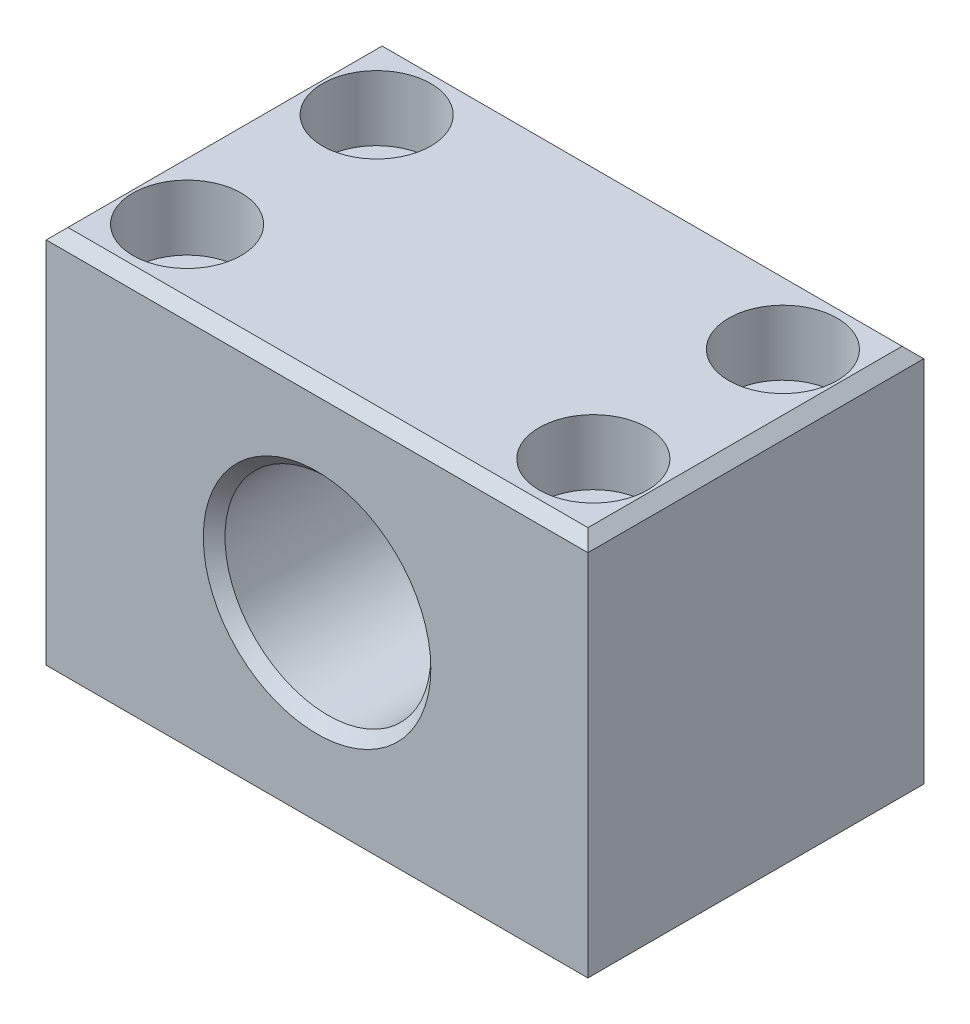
ISO-10303-21;
HEADER;
FILE_DESCRIPTION(('STEP AP214'),'2;1');
FILE_NAME('part.step','',(''),(''),'','','');
FILE_SCHEMA(('AUTOMOTIVE_DESIGN { 1 0 10303 214 1 1 1 1 }'));
ENDSEC;
DATA;
#1=APPLICATION_CONTEXT('core data for automotive mechanical design processes');
#2=APPLICATION_PROTOCOL_DEFINITION('international standard','automotive_design',2000,#1);
#3=PRODUCT_CONTEXT('',#1,'mechanical');
#4=PRODUCT('Part','Part','',(#3));
#5=PRODUCT_RELATED_PRODUCT_CATEGORY('part','',(#4));
#6=PRODUCT_DEFINITION_FORMATION('','',#4);
#7=PRODUCT_DEFINITION_CONTEXT('part definition',#1,'design');
#8=PRODUCT_DEFINITION('design','',#6,#7);
#9=PRODUCT_DEFINITION_SHAPE('','',#8);
#10=(LENGTH_UNIT() NAMED_UNIT(*) SI_UNIT(.MILLI.,.METRE.));
#11=(NAMED_UNIT(*) PLANE_ANGLE_UNIT() SI_UNIT($,.RADIAN.));
#12=(NAMED_UNIT(*) SI_UNIT($,.STERADIAN.) SOLID_ANGLE_UNIT());
#13=UNCERTAINTY_MEASURE_WITH_UNIT(LENGTH_MEASURE(1.E-05),#10,'distance_accuracy_value','');
#14=(GEOMETRIC_REPRESENTATION_CONTEXT(3) GLOBAL_UNCERTAINTY_ASSIGNED_CONTEXT((#13)) GLOBAL_UNIT_ASSIGNED_CONTEXT((#10,
#11,#12)) REPRESENTATION_CONTEXT('',''));
#15=CARTESIAN_POINT('',(0.,0.,0.));
#16=DIRECTION('',(0.,0.,1.));
#17=DIRECTION('',(1.,0.,0.));
#18=AXIS2_PLACEMENT_3D('',#15,#16,#17);
#19=CARTESIAN_POINT('',(-50.,35.,31.));
#20=DIRECTION('',(1.,0.,0.));
#21=DIRECTION('',(0.,1.,0.));
#22=AXIS2_PLACEMENT_3D('',#19,#20,#21);
#23=PLANE('',#22);
#24=DIRECTION('',(0.,-1.,0.));
#25=VECTOR('',#24,1.);
#26=CARTESIAN_POINT('',(-50.,35.,31.));
#27=LINE('',#26,#25);
#28=CARTESIAN_POINT('',(-50.,33.,31.));
#29=VERTEX_POINT('',#28);
#30=CARTESIAN_POINT('',(-50.,-35.,31.));
#31=VERTEX_POINT('',#30);
#32=EDGE_CURVE('E88',#29,#31,#27,.T.);
#33=ORIENTED_EDGE('',*,*,#32,.F.);
#34=DIRECTION('',(0.,0.,-1.));
#35=VECTOR('',#34,1.);
#36=CARTESIAN_POINT('',(-50.,33.,31.));
#37=LINE('',#36,#35);
#38=CARTESIAN_POINT('',(-50.,33.,-31.));
#39=VERTEX_POINT('',#38);
#40=EDGE_CURVE('E52',#29,#39,#37,.T.);
#41=ORIENTED_EDGE('',*,*,#40,.T.);
#42=DIRECTION('',(0.,-1.,0.));
#43=VECTOR('',#42,1.);
#44=CARTESIAN_POINT('',(-50.,35.,-31.));
#45=LINE('',#44,#43);
#46=CARTESIAN_POINT('',(-50.,-35.,-31.));
#47=VERTEX_POINT('',#46);
#48=EDGE_CURVE('E105',#39,#47,#45,.T.);
#49=ORIENTED_EDGE('',*,*,#48,.T.);
#50=DIRECTION('',(0.,0.,-1.));
#51=VECTOR('',#50,1.);
#52=CARTESIAN_POINT('',(-50.,-35.,31.));
#53=LINE('',#52,#51);
#54=EDGE_CURVE('E99',#31,#47,#53,.T.);
#55=ORIENTED_EDGE('',*,*,#54,.F.);
#56=EDGE_LOOP('',(#33,#41,#49,#55));
#57=FACE_BOUND('',#56,.T.);
#58=ADVANCED_FACE('F35',(#57),#23,.F.);
#59=CARTESIAN_POINT('',(-50.,-35.,31.));
#60=DIRECTION('',(0.,1.,0.));
#61=DIRECTION('',(0.,0.,1.));
#62=AXIS2_PLACEMENT_3D('',#59,#60,#61);
#63=PLANE('',#62);
#64=CARTESIAN_POINT('',(37.5,-35.,17.5));
#65=DIRECTION('',(0.,1.,0.));
#66=DIRECTION('',(0.,0.,1.));
#67=AXIS2_PLACEMENT_3D('',#64,#65,#66);
#68=CIRCLE('',#67,6.09999999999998);
#69=CARTESIAN_POINT('',(37.5,-35.,23.6));
#70=VERTEX_POINT('',#69);
#71=EDGE_CURVE('E419',#70,#70,#68,.T.);
#72=ORIENTED_EDGE('',*,*,#71,.T.);
#73=EDGE_LOOP('',(#72));
#74=FACE_BOUND('',#73,.T.);
#75=CARTESIAN_POINT('',(37.5,-35.,-17.5));
#76=DIRECTION('',(0.,1.,0.));
#77=DIRECTION('',(0.,0.,1.));
#78=AXIS2_PLACEMENT_3D('',#75,#76,#77);
#79=CIRCLE('',#78,6.09999999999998);
#80=CARTESIAN_POINT('',(37.5,-35.,-11.4));
#81=VERTEX_POINT('',#80);
#82=EDGE_CURVE('E431',#81,#81,#79,.T.);
#83=ORIENTED_EDGE('',*,*,#82,.T.);
#84=EDGE_LOOP('',(#83));
#85=FACE_BOUND('',#84,.T.);
#86=CARTESIAN_POINT('',(-37.5,-35.,17.5));
#87=DIRECTION('',(0.,1.,0.));
#88=DIRECTION('',(0.,0.,1.));
#89=AXIS2_PLACEMENT_3D('',#86,#87,#88);
#90=CIRCLE('',#89,6.09999999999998);
#91=CARTESIAN_POINT('',(-37.5,-35.,23.6));
#92=VERTEX_POINT('',#91);
#93=EDGE_CURVE('E443',#92,#92,#90,.T.);
#94=ORIENTED_EDGE('',*,*,#93,.T.);
#95=EDGE_LOOP('',(#94));
#96=FACE_BOUND('',#95,.T.);
#97=CARTESIAN_POINT('',(-37.5,-35.,-17.5));
#98=DIRECTION('',(0.,1.,0.));
#99=DIRECTION('',(0.,0.,1.));
#100=AXIS2_PLACEMENT_3D('',#97,#98,#99);
#101=CIRCLE('',#100,6.09999999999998);
#102=CARTESIAN_POINT('',(-37.5,-35.,-11.4));
#103=VERTEX_POINT('',#102);
#104=EDGE_CURVE('E138',#103,#103,#101,.T.);
#105=ORIENTED_EDGE('',*,*,#104,.T.);
#106=EDGE_LOOP('',(#105));
#107=FACE_BOUND('',#106,.T.);
#108=DIRECTION('',(1.,0.,0.));
#109=VECTOR('',#108,1.);
#110=CARTESIAN_POINT('',(-50.,-35.,-31.));
#111=LINE('',#110,#109);
#112=CARTESIAN_POINT('',(50.,-35.,-31.));
#113=VERTEX_POINT('',#112);
#114=EDGE_CURVE('E149',#47,#113,#111,.T.);
#115=ORIENTED_EDGE('',*,*,#114,.T.);
#116=DIRECTION('',(0.,0.,-1.));
#117=VECTOR('',#116,1.);
#118=CARTESIAN_POINT('',(50.,-35.,31.));
#119=LINE('',#118,#117);
#120=CARTESIAN_POINT('',(50.,-35.,31.));
#121=VERTEX_POINT('',#120);
#122=EDGE_CURVE('E101',#121,#113,#119,.T.);
#123=ORIENTED_EDGE('',*,*,#122,.F.);
#124=DIRECTION('',(1.,0.,0.));
#125=VECTOR('',#124,1.);
#126=CARTESIAN_POINT('',(-50.,-35.,31.));
#127=LINE('',#126,#125);
#128=EDGE_CURVE('E91',#31,#121,#127,.T.);
#129=ORIENTED_EDGE('',*,*,#128,.F.);
#130=ORIENTED_EDGE('',*,*,#54,.T.);
#131=EDGE_LOOP('',(#115,#123,#129,#130));
#132=FACE_BOUND('',#131,.T.);
#133=ADVANCED_FACE('F98',(#74,#85,#96,#107,#132),#63,.F.);
#134=CARTESIAN_POINT('',(50.,35.,31.));
#135=DIRECTION('',(-1.,0.,0.));
#136=DIRECTION('',(0.,-1.,0.));
#137=AXIS2_PLACEMENT_3D('',#134,#135,#136);
#138=PLANE('',#137);
#139=DIRECTION('',(0.,1.,0.));
#140=VECTOR('',#139,1.);
#141=CARTESIAN_POINT('',(50.,35.,-31.));
#142=LINE('',#141,#140);
#143=CARTESIAN_POINT('',(50.,33.,-31.));
#144=VERTEX_POINT('',#143);
#145=EDGE_CURVE('E94',#113,#144,#142,.T.);
#146=ORIENTED_EDGE('',*,*,#145,.T.);
#147=DIRECTION('',(0.,0.,1.));
#148=VECTOR('',#147,1.);
#149=CARTESIAN_POINT('',(50.,33.,31.));
#150=LINE('',#149,#148);
#151=CARTESIAN_POINT('',(50.,33.,31.));
#152=VERTEX_POINT('',#151);
#153=EDGE_CURVE('E120',#144,#152,#150,.T.);
#154=ORIENTED_EDGE('',*,*,#153,.T.);
#155=DIRECTION('',(0.,1.,0.));
#156=VECTOR('',#155,1.);
#157=CARTESIAN_POINT('',(50.,35.,31.));
#158=LINE('',#157,#156);
#159=EDGE_CURVE('E103',#121,#152,#158,.T.);
#160=ORIENTED_EDGE('',*,*,#159,.F.);
#161=ORIENTED_EDGE('',*,*,#122,.T.);
#162=EDGE_LOOP('',(#146,#154,#160,#161));
#163=FACE_BOUND('',#162,.T.);
#164=ADVANCED_FACE('F157',(#163),#138,.F.);
#165=CARTESIAN_POINT('',(-50.,35.,31.));
#166=DIRECTION('',(0.,-1.,0.));
#167=DIRECTION('',(0.,0.,-1.));
#168=AXIS2_PLACEMENT_3D('',#165,#166,#167);
#169=PLANE('',#168);
#170=CARTESIAN_POINT('',(37.5,35.,17.5));
#171=DIRECTION('',(0.,1.,0.));
#172=DIRECTION('',(0.,0.,1.));
#173=AXIS2_PLACEMENT_3D('',#170,#171,#172);
#174=CIRCLE('',#173,10.);
#175=CARTESIAN_POINT('',(37.5,35.,27.5));
#176=VERTEX_POINT('',#175);
#177=EDGE_CURVE('E412',#176,#176,#174,.T.);
#178=ORIENTED_EDGE('',*,*,#177,.F.);
#179=EDGE_LOOP('',(#178));
#180=FACE_BOUND('',#179,.T.);
#181=CARTESIAN_POINT('',(37.5,35.,-17.5));
#182=DIRECTION('',(0.,1.,0.));
#183=DIRECTION('',(0.,0.,1.));
#184=AXIS2_PLACEMENT_3D('',#181,#182,#183);
#185=CIRCLE('',#184,10.);
#186=CARTESIAN_POINT('',(37.5,35.,-7.5));
#187=VERTEX_POINT('',#186);
#188=EDGE_CURVE('E422',#187,#187,#185,.T.);
#189=ORIENTED_EDGE('',*,*,#188,.F.);
#190=EDGE_LOOP('',(#189));
#191=FACE_BOUND('',#190,.T.);
#192=CARTESIAN_POINT('',(-37.5,35.,17.5));
#193=DIRECTION('',(0.,1.,0.));
#194=DIRECTION('',(0.,0.,1.));
#195=AXIS2_PLACEMENT_3D('',#192,#193,#194);
#196=CIRCLE('',#195,10.);
#197=CARTESIAN_POINT('',(-37.5,35.,27.5));
#198=VERTEX_POINT('',#197);
#199=EDGE_CURVE('E434',#198,#198,#196,.T.);
#200=ORIENTED_EDGE('',*,*,#199,.F.);
#201=EDGE_LOOP('',(#200));
#202=FACE_BOUND('',#201,.T.);
#203=CARTESIAN_POINT('',(-37.5,35.,-17.5));
#204=DIRECTION('',(0.,1.,0.));
#205=DIRECTION('',(0.,0.,1.));
#206=AXIS2_PLACEMENT_3D('',#203,#204,#205);
#207=CIRCLE('',#206,10.);
#208=CARTESIAN_POINT('',(-37.5,35.,-7.5));
#209=VERTEX_POINT('',#208);
#210=EDGE_CURVE('E446',#209,#209,#207,.T.);
#211=ORIENTED_EDGE('',*,*,#210,.F.);
#212=EDGE_LOOP('',(#211));
#213=FACE_BOUND('',#212,.T.);
#214=DIRECTION('',(1.,0.,0.));
#215=VECTOR('',#214,1.);
#216=CARTESIAN_POINT('',(50.,35.,29.));
#217=LINE('',#216,#215);
#218=CARTESIAN_POINT('',(-48.,35.,29.));
#219=VERTEX_POINT('',#218);
#220=CARTESIAN_POINT('',(48.,35.,29.));
#221=VERTEX_POINT('',#220);
#222=EDGE_CURVE('E115',#219,#221,#217,.T.);
#223=ORIENTED_EDGE('',*,*,#222,.T.);
#224=DIRECTION('',(0.,0.,-1.));
#225=VECTOR('',#224,1.);
#226=CARTESIAN_POINT('',(48.,35.,31.));
#227=LINE('',#226,#225);
#228=CARTESIAN_POINT('',(48.,35.,-29.));
#229=VERTEX_POINT('',#228);
#230=EDGE_CURVE('E117',#221,#229,#227,.T.);
#231=ORIENTED_EDGE('',*,*,#230,.T.);
#232=DIRECTION('',(-1.,0.,0.));
#233=VECTOR('',#232,1.);
#234=CARTESIAN_POINT('',(-50.,35.,-29.));
#235=LINE('',#234,#233);
#236=CARTESIAN_POINT('',(-48.,35.,-29.));
#237=VERTEX_POINT('',#236);
#238=EDGE_CURVE('E107',#229,#237,#235,.T.);
#239=ORIENTED_EDGE('',*,*,#238,.T.);
#240=DIRECTION('',(0.,0.,1.));
#241=VECTOR('',#240,1.);
#242=CARTESIAN_POINT('',(-48.,35.,31.));
#243=LINE('',#242,#241);
#244=EDGE_CURVE('E109',#237,#219,#243,.T.);
#245=ORIENTED_EDGE('',*,*,#244,.T.);
#246=EDGE_LOOP('',(#223,#231,#239,#245));
#247=FACE_BOUND('',#246,.T.);
#248=ADVANCED_FACE('F167',(#180,#191,#202,#213,#247),#169,.F.);
#249=CARTESIAN_POINT('',(0.,0.,31.));
#250=DIRECTION('',(0.,0.,1.));
#251=DIRECTION('',(1.,0.,0.));
#252=AXIS2_PLACEMENT_3D('',#249,#250,#251);
#253=PLANE('',#252);
#254=CARTESIAN_POINT('',(0.,0.,31.));
#255=DIRECTION('',(0.,0.,1.));
#256=DIRECTION('',(1.,0.,0.));
#257=AXIS2_PLACEMENT_3D('',#254,#255,#256);
#258=CIRCLE('',#257,21.);
#259=CARTESIAN_POINT('',(21.,0.,31.));
#260=VERTEX_POINT('',#259);
#261=EDGE_CURVE('E123',#260,#260,#258,.F.);
#262=ORIENTED_EDGE('',*,*,#261,.T.);
#263=EDGE_LOOP('',(#262));
#264=FACE_BOUND('',#263,.T.);
#265=ORIENTED_EDGE('',*,*,#159,.T.);
#266=DIRECTION('',(-1.,0.,0.));
#267=VECTOR('',#266,1.);
#268=CARTESIAN_POINT('',(-50.,33.,31.));
#269=LINE('',#268,#267);
#270=EDGE_CURVE('E60',#152,#29,#269,.T.);
#271=ORIENTED_EDGE('',*,*,#270,.T.);
#272=ORIENTED_EDGE('',*,*,#32,.T.);
#273=ORIENTED_EDGE('',*,*,#128,.T.);
#274=EDGE_LOOP('',(#265,#271,#272,#273));
#275=FACE_BOUND('',#274,.T.);
#276=ADVANCED_FACE('F90',(#264,#275),#253,.T.);
#277=CARTESIAN_POINT('',(0.,0.,-31.));
#278=DIRECTION('',(0.,0.,1.));
#279=DIRECTION('',(1.,0.,0.));
#280=AXIS2_PLACEMENT_3D('',#277,#278,#279);
#281=PLANE('',#280);
#282=CARTESIAN_POINT('',(0.,0.,-31.));
#283=DIRECTION('',(0.,0.,1.));
#284=DIRECTION('',(1.,0.,0.));
#285=AXIS2_PLACEMENT_3D('',#282,#283,#284);
#286=CIRCLE('',#285,21.);
#287=CARTESIAN_POINT('',(21.,0.,-31.));
#288=VERTEX_POINT('',#287);
#289=EDGE_CURVE('E128',#288,#288,#286,.T.);
#290=ORIENTED_EDGE('',*,*,#289,.T.);
#291=EDGE_LOOP('',(#290));
#292=FACE_BOUND('',#291,.T.);
#293=ORIENTED_EDGE('',*,*,#48,.F.);
#294=DIRECTION('',(1.,0.,0.));
#295=VECTOR('',#294,1.);
#296=CARTESIAN_POINT('',(0.,33.,-31.));
#297=LINE('',#296,#295);
#298=EDGE_CURVE('E131',#39,#144,#297,.T.);
#299=ORIENTED_EDGE('',*,*,#298,.T.);
#300=ORIENTED_EDGE('',*,*,#145,.F.);
#301=ORIENTED_EDGE('',*,*,#114,.F.);
#302=EDGE_LOOP('',(#293,#299,#300,#301));
#303=FACE_BOUND('',#302,.T.);
#304=ADVANCED_FACE('F204',(#292,#303),#281,.F.);
#305=CARTESIAN_POINT('',(0.,0.,-31.));
#306=DIRECTION('',(0.,0.,1.));
#307=DIRECTION('',(1.,0.,0.));
#308=AXIS2_PLACEMENT_3D('',#305,#306,#307);
#309=CYLINDRICAL_SURFACE('',#308,19.);
#310=CARTESIAN_POINT('',(0.,0.,-29.));
#311=DIRECTION('',(0.,0.,1.));
#312=DIRECTION('',(1.,0.,0.));
#313=AXIS2_PLACEMENT_3D('',#310,#311,#312);
#314=CIRCLE('',#313,19.);
#315=CARTESIAN_POINT('',(19.,0.,-29.));
#316=VERTEX_POINT('',#315);
#317=EDGE_CURVE('E11',#316,#316,#314,.F.);
#318=ORIENTED_EDGE('',*,*,#317,.T.);
#319=EDGE_LOOP('',(#318));
#320=FACE_BOUND('',#319,.T.);
#321=CARTESIAN_POINT('',(0.,0.,29.));
#322=DIRECTION('',(0.,0.,1.));
#323=DIRECTION('',(1.,0.,0.));
#324=AXIS2_PLACEMENT_3D('',#321,#322,#323);
#325=CIRCLE('',#324,19.);
#326=CARTESIAN_POINT('',(19.,0.,29.));
#327=VERTEX_POINT('',#326);
#328=EDGE_CURVE('E44',#327,#327,#325,.T.);
#329=ORIENTED_EDGE('',*,*,#328,.T.);
#330=EDGE_LOOP('',(#329));
#331=FACE_BOUND('',#330,.T.);
#332=ADVANCED_FACE('F177',(#320,#331),#309,.F.);
#333=CARTESIAN_POINT('',(-50.,33.,31.));
#334=DIRECTION('',(0.70710678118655,-0.707106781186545,0.));
#335=DIRECTION('',(0.,0.,-1.));
#336=AXIS2_PLACEMENT_3D('',#333,#334,#335);
#337=PLANE('',#336);
#338=DIRECTION('',(0.577350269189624,0.577350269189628,0.577350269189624));
#339=VECTOR('',#338,1.);
#340=CARTESIAN_POINT('',(-48.6666666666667,34.3333333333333,-29.6666666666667));
#341=LINE('',#340,#339);
#342=EDGE_CURVE('E139',#39,#237,#341,.T.);
#343=ORIENTED_EDGE('',*,*,#342,.F.);
#344=ORIENTED_EDGE('',*,*,#40,.F.);
#345=DIRECTION('',(-0.577350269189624,-0.577350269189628,0.577350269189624));
#346=VECTOR('',#345,1.);
#347=CARTESIAN_POINT('',(-50.,33.,31.));
#348=LINE('',#347,#346);
#349=EDGE_CURVE('E39',#219,#29,#348,.T.);
#350=ORIENTED_EDGE('',*,*,#349,.F.);
#351=ORIENTED_EDGE('',*,*,#244,.F.);
#352=EDGE_LOOP('',(#343,#344,#350,#351));
#353=FACE_BOUND('',#352,.T.);
#354=ADVANCED_FACE('F170',(#353),#337,.F.);
#355=CARTESIAN_POINT('',(0.,33.,31.));
#356=DIRECTION('',(0.,0.707106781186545,0.70710678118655));
#357=DIRECTION('',(1.,0.,0.));
#358=AXIS2_PLACEMENT_3D('',#355,#356,#357);
#359=PLANE('',#358);
#360=ORIENTED_EDGE('',*,*,#349,.T.);
#361=ORIENTED_EDGE('',*,*,#270,.F.);
#362=DIRECTION('',(0.577350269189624,-0.577350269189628,0.577350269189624));
#363=VECTOR('',#362,1.);
#364=CARTESIAN_POINT('',(33.3333333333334,49.6666666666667,14.3333333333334));
#365=LINE('',#364,#363);
#366=EDGE_CURVE('E137',#221,#152,#365,.T.);
#367=ORIENTED_EDGE('',*,*,#366,.F.);
#368=ORIENTED_EDGE('',*,*,#222,.F.);
#369=EDGE_LOOP('',(#360,#361,#367,#368));
#370=FACE_BOUND('',#369,.T.);
#371=ADVANCED_FACE('F168',(#370),#359,.T.);
#372=CARTESIAN_POINT('',(-50.,35.,-29.));
#373=DIRECTION('',(0.,-0.707106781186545,0.70710678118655));
#374=DIRECTION('',(-1.,0.,0.));
#375=AXIS2_PLACEMENT_3D('',#372,#373,#374);
#376=PLANE('',#375);
#377=ORIENTED_EDGE('',*,*,#342,.T.);
#378=ORIENTED_EDGE('',*,*,#238,.F.);
#379=DIRECTION('',(0.577350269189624,-0.577350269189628,-0.577350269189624));
#380=VECTOR('',#379,1.);
#381=CARTESIAN_POINT('',(15.3333333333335,67.6666666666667,3.66666666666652));
#382=LINE('',#381,#380);
#383=EDGE_CURVE('E135',#144,#229,#382,.F.);
#384=ORIENTED_EDGE('',*,*,#383,.F.);
#385=ORIENTED_EDGE('',*,*,#298,.F.);
#386=EDGE_LOOP('',(#377,#378,#384,#385));
#387=FACE_BOUND('',#386,.T.);
#388=ADVANCED_FACE('F164',(#387),#376,.F.);
#389=CARTESIAN_POINT('',(48.,35.,31.));
#390=DIRECTION('',(-0.70710678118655,-0.707106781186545,0.));
#391=DIRECTION('',(0.,0.,-1.));
#392=AXIS2_PLACEMENT_3D('',#389,#390,#391);
#393=PLANE('',#392);
#394=ORIENTED_EDGE('',*,*,#366,.T.);
#395=ORIENTED_EDGE('',*,*,#153,.F.);
#396=ORIENTED_EDGE('',*,*,#383,.T.);
#397=ORIENTED_EDGE('',*,*,#230,.F.);
#398=EDGE_LOOP('',(#394,#395,#396,#397));
#399=FACE_BOUND('',#398,.T.);
#400=ADVANCED_FACE('F161',(#399),#393,.F.);
#401=CARTESIAN_POINT('',(0.,0.,-31.));
#402=DIRECTION('',(0.,0.,-1.));
#403=DIRECTION('',(-1.,0.,0.));
#404=AXIS2_PLACEMENT_3D('',#401,#402,#403);
#405=CONICAL_SURFACE('',#404,21.,0.785398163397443);
#406=ORIENTED_EDGE('',*,*,#317,.F.);
#407=EDGE_LOOP('',(#406));
#408=FACE_BOUND('',#407,.T.);
#409=ORIENTED_EDGE('',*,*,#289,.F.);
#410=EDGE_LOOP('',(#409));
#411=FACE_BOUND('',#410,.T.);
#412=ADVANCED_FACE('F190',(#408,#411),#405,.F.);
#413=CARTESIAN_POINT('',(0.,0.,29.));
#414=DIRECTION('',(0.,0.,1.));
#415=DIRECTION('',(1.,0.,0.));
#416=AXIS2_PLACEMENT_3D('',#413,#414,#415);
#417=CONICAL_SURFACE('',#416,19.,0.785398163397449);
#418=ORIENTED_EDGE('',*,*,#261,.F.);
#419=EDGE_LOOP('',(#418));
#420=FACE_BOUND('',#419,.T.);
#421=ORIENTED_EDGE('',*,*,#328,.F.);
#422=EDGE_LOOP('',(#421));
#423=FACE_BOUND('',#422,.T.);
#424=ADVANCED_FACE('F37',(#420,#423),#417,.F.);
#425=CARTESIAN_POINT('',(-37.5,35.,-17.5));
#426=DIRECTION('',(0.,1.,0.));
#427=DIRECTION('',(0.,0.,1.));
#428=AXIS2_PLACEMENT_3D('',#425,#426,#427);
#429=CYLINDRICAL_SURFACE('',#428,6.09999999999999);
#430=ORIENTED_EDGE('',*,*,#104,.F.);
#431=EDGE_LOOP('',(#430));
#432=FACE_BOUND('',#431,.T.);
#433=CARTESIAN_POINT('',(-37.5,23.,-17.5));
#434=DIRECTION('',(0.,1.,0.));
#435=DIRECTION('',(0.,0.,1.));
#436=AXIS2_PLACEMENT_3D('',#433,#434,#435);
#437=CIRCLE('',#436,6.1);
#438=CARTESIAN_POINT('',(-37.5,23.,-11.4));
#439=VERTEX_POINT('',#438);
#440=EDGE_CURVE('E452',#439,#439,#437,.T.);
#441=ORIENTED_EDGE('',*,*,#440,.T.);
#442=EDGE_LOOP('',(#441));
#443=FACE_BOUND('',#442,.T.);
#444=ADVANCED_FACE('F198',(#432,#443),#429,.F.);
#445=CARTESIAN_POINT('',(-31.4,23.,-17.5));
#446=DIRECTION('',(0.,-1.,0.));
#447=DIRECTION('',(0.,0.,-1.));
#448=AXIS2_PLACEMENT_3D('',#445,#446,#447);
#449=PLANE('',#448);
#450=ORIENTED_EDGE('',*,*,#440,.F.);
#451=EDGE_LOOP('',(#450));
#452=FACE_BOUND('',#451,.T.);
#453=CARTESIAN_POINT('',(-37.5,23.,-17.5));
#454=DIRECTION('',(0.,1.,0.));
#455=DIRECTION('',(0.,0.,1.));
#456=AXIS2_PLACEMENT_3D('',#453,#454,#455);
#457=CIRCLE('',#456,9.99999999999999);
#458=CARTESIAN_POINT('',(-37.5,23.,-7.50000000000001));
#459=VERTEX_POINT('',#458);
#460=EDGE_CURVE('E449',#459,#459,#457,.T.);
#461=ORIENTED_EDGE('',*,*,#460,.T.);
#462=EDGE_LOOP('',(#461));
#463=FACE_BOUND('',#462,.T.);
#464=ADVANCED_FACE('F281',(#452,#463),#449,.F.);
#465=CARTESIAN_POINT('',(-37.5,35.,-17.5));
#466=DIRECTION('',(0.,1.,0.));
#467=DIRECTION('',(0.,0.,1.));
#468=AXIS2_PLACEMENT_3D('',#465,#466,#467);
#469=CYLINDRICAL_SURFACE('',#468,10.);
#470=ORIENTED_EDGE('',*,*,#460,.F.);
#471=EDGE_LOOP('',(#470));
#472=FACE_BOUND('',#471,.T.);
#473=ORIENTED_EDGE('',*,*,#210,.T.);
#474=EDGE_LOOP('',(#473));
#475=FACE_BOUND('',#474,.T.);
#476=ADVANCED_FACE('F291',(#472,#475),#469,.F.);
#477=CARTESIAN_POINT('',(-37.5,35.,17.5));
#478=DIRECTION('',(0.,1.,0.));
#479=DIRECTION('',(0.,0.,1.));
#480=AXIS2_PLACEMENT_3D('',#477,#478,#479);
#481=CYLINDRICAL_SURFACE('',#480,6.09999999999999);
#482=ORIENTED_EDGE('',*,*,#93,.F.);
#483=EDGE_LOOP('',(#482));
#484=FACE_BOUND('',#483,.T.);
#485=CARTESIAN_POINT('',(-37.5,23.,17.5));
#486=DIRECTION('',(0.,1.,0.));
#487=DIRECTION('',(0.,0.,1.));
#488=AXIS2_PLACEMENT_3D('',#485,#486,#487);
#489=CIRCLE('',#488,6.1);
#490=CARTESIAN_POINT('',(-37.5,23.,23.6));
#491=VERTEX_POINT('',#490);
#492=EDGE_CURVE('E440',#491,#491,#489,.T.);
#493=ORIENTED_EDGE('',*,*,#492,.T.);
#494=EDGE_LOOP('',(#493));
#495=FACE_BOUND('',#494,.T.);
#496=ADVANCED_FACE('F300',(#484,#495),#481,.F.);
#497=CARTESIAN_POINT('',(-31.4,23.,17.5));
#498=DIRECTION('',(0.,-1.,0.));
#499=DIRECTION('',(0.,0.,-1.));
#500=AXIS2_PLACEMENT_3D('',#497,#498,#499);
#501=PLANE('',#500);
#502=ORIENTED_EDGE('',*,*,#492,.F.);
#503=EDGE_LOOP('',(#502));
#504=FACE_BOUND('',#503,.T.);
#505=CARTESIAN_POINT('',(-37.5,23.,17.5));
#506=DIRECTION('',(0.,1.,0.));
#507=DIRECTION('',(0.,0.,1.));
#508=AXIS2_PLACEMENT_3D('',#505,#506,#507);
#509=CIRCLE('',#508,9.99999999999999);
#510=CARTESIAN_POINT('',(-37.5,23.,27.5));
#511=VERTEX_POINT('',#510);
#512=EDGE_CURVE('E437',#511,#511,#509,.T.);
#513=ORIENTED_EDGE('',*,*,#512,.T.);
#514=EDGE_LOOP('',(#513));
#515=FACE_BOUND('',#514,.T.);
#516=ADVANCED_FACE('F322',(#504,#515),#501,.F.);
#517=CARTESIAN_POINT('',(-37.5,35.,17.5));
#518=DIRECTION('',(0.,1.,0.));
#519=DIRECTION('',(0.,0.,1.));
#520=AXIS2_PLACEMENT_3D('',#517,#518,#519);
#521=CYLINDRICAL_SURFACE('',#520,10.);
#522=ORIENTED_EDGE('',*,*,#512,.F.);
#523=EDGE_LOOP('',(#522));
#524=FACE_BOUND('',#523,.T.);
#525=ORIENTED_EDGE('',*,*,#199,.T.);
#526=EDGE_LOOP('',(#525));
#527=FACE_BOUND('',#526,.T.);
#528=ADVANCED_FACE('F329',(#524,#527),#521,.F.);
#529=CARTESIAN_POINT('',(37.5,35.,-17.5));
#530=DIRECTION('',(0.,1.,0.));
#531=DIRECTION('',(0.,0.,1.));
#532=AXIS2_PLACEMENT_3D('',#529,#530,#531);
#533=CYLINDRICAL_SURFACE('',#532,6.09999999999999);
#534=ORIENTED_EDGE('',*,*,#82,.F.);
#535=EDGE_LOOP('',(#534));
#536=FACE_BOUND('',#535,.T.);
#537=CARTESIAN_POINT('',(37.5,23.,-17.5));
#538=DIRECTION('',(0.,1.,0.));
#539=DIRECTION('',(0.,0.,1.));
#540=AXIS2_PLACEMENT_3D('',#537,#538,#539);
#541=CIRCLE('',#540,6.1);
#542=CARTESIAN_POINT('',(37.5,23.,-11.4));
#543=VERTEX_POINT('',#542);
#544=EDGE_CURVE('E428',#543,#543,#541,.T.);
#545=ORIENTED_EDGE('',*,*,#544,.T.);
#546=EDGE_LOOP('',(#545));
#547=FACE_BOUND('',#546,.T.);
#548=ADVANCED_FACE('F337',(#536,#547),#533,.F.);
#549=CARTESIAN_POINT('',(43.6,23.,-17.5));
#550=DIRECTION('',(0.,-1.,0.));
#551=DIRECTION('',(0.,0.,-1.));
#552=AXIS2_PLACEMENT_3D('',#549,#550,#551);
#553=PLANE('',#552);
#554=ORIENTED_EDGE('',*,*,#544,.F.);
#555=EDGE_LOOP('',(#554));
#556=FACE_BOUND('',#555,.T.);
#557=CARTESIAN_POINT('',(37.5,23.,-17.5));
#558=DIRECTION('',(0.,1.,0.));
#559=DIRECTION('',(0.,0.,1.));
#560=AXIS2_PLACEMENT_3D('',#557,#558,#559);
#561=CIRCLE('',#560,9.99999999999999);
#562=CARTESIAN_POINT('',(37.5,23.,-7.50000000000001));
#563=VERTEX_POINT('',#562);
#564=EDGE_CURVE('E425',#563,#563,#561,.T.);
#565=ORIENTED_EDGE('',*,*,#564,.T.);
#566=EDGE_LOOP('',(#565));
#567=FACE_BOUND('',#566,.T.);
#568=ADVANCED_FACE('F345',(#556,#567),#553,.F.);
#569=CARTESIAN_POINT('',(37.5,35.,-17.5));
#570=DIRECTION('',(0.,1.,0.));
#571=DIRECTION('',(0.,0.,1.));
#572=AXIS2_PLACEMENT_3D('',#569,#570,#571);
#573=CYLINDRICAL_SURFACE('',#572,10.);
#574=ORIENTED_EDGE('',*,*,#564,.F.);
#575=EDGE_LOOP('',(#574));
#576=FACE_BOUND('',#575,.T.);
#577=ORIENTED_EDGE('',*,*,#188,.T.);
#578=EDGE_LOOP('',(#577));
#579=FACE_BOUND('',#578,.T.);
#580=ADVANCED_FACE('F353',(#576,#579),#573,.F.);
#581=CARTESIAN_POINT('',(37.5,35.,17.5));
#582=DIRECTION('',(0.,1.,0.));
#583=DIRECTION('',(0.,0.,1.));
#584=AXIS2_PLACEMENT_3D('',#581,#582,#583);
#585=CYLINDRICAL_SURFACE('',#584,6.09999999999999);
#586=ORIENTED_EDGE('',*,*,#71,.F.);
#587=EDGE_LOOP('',(#586));
#588=FACE_BOUND('',#587,.T.);
#589=CARTESIAN_POINT('',(37.5,23.,17.5));
#590=DIRECTION('',(0.,1.,0.));
#591=DIRECTION('',(0.,0.,1.));
#592=AXIS2_PLACEMENT_3D('',#589,#590,#591);
#593=CIRCLE('',#592,6.1);
#594=CARTESIAN_POINT('',(37.5,23.,23.6));
#595=VERTEX_POINT('',#594);
#596=EDGE_CURVE('E414',#595,#595,#593,.T.);
#597=ORIENTED_EDGE('',*,*,#596,.T.);
#598=EDGE_LOOP('',(#597));
#599=FACE_BOUND('',#598,.T.);
#600=ADVANCED_FACE('F361',(#588,#599),#585,.F.);
#601=CARTESIAN_POINT('',(43.6,23.,17.5));
#602=DIRECTION('',(0.,-1.,0.));
#603=DIRECTION('',(0.,0.,-1.));
#604=AXIS2_PLACEMENT_3D('',#601,#602,#603);
#605=PLANE('',#604);
#606=ORIENTED_EDGE('',*,*,#596,.F.);
#607=EDGE_LOOP('',(#606));
#608=FACE_BOUND('',#607,.T.);
#609=CARTESIAN_POINT('',(37.5,23.,17.5));
#610=DIRECTION('',(0.,1.,0.));
#611=DIRECTION('',(0.,0.,1.));
#612=AXIS2_PLACEMENT_3D('',#609,#610,#611);
#613=CIRCLE('',#612,9.99999999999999);
#614=CARTESIAN_POINT('',(37.5,23.,27.5));
#615=VERTEX_POINT('',#614);
#616=EDGE_CURVE('E409',#615,#615,#613,.T.);
#617=ORIENTED_EDGE('',*,*,#616,.T.);
#618=EDGE_LOOP('',(#617));
#619=FACE_BOUND('',#618,.T.);
#620=ADVANCED_FACE('F369',(#608,#619),#605,.F.);
#621=CARTESIAN_POINT('',(37.5,35.,17.5));
#622=DIRECTION('',(0.,1.,0.));
#623=DIRECTION('',(0.,0.,1.));
#624=AXIS2_PLACEMENT_3D('',#621,#622,#623);
#625=CYLINDRICAL_SURFACE('',#624,10.);
#626=ORIENTED_EDGE('',*,*,#616,.F.);
#627=EDGE_LOOP('',(#626));
#628=FACE_BOUND('',#627,.T.);
#629=ORIENTED_EDGE('',*,*,#177,.T.);
#630=EDGE_LOOP('',(#629));
#631=FACE_BOUND('',#630,.T.);
#632=ADVANCED_FACE('F377',(#628,#631),#625,.F.);
#633=CLOSED_SHELL('',(#58,#133,#164,#248,#276,#304,#332,#354,#371,#388,#400,#412,#424,#444,#464,
#476,#496,#516,#528,#548,#568,#580,#600,#620,#632));
#634=MANIFOLD_SOLID_BREP('B2',#633);
#635=ADVANCED_BREP_SHAPE_REPRESENTATION('',(#18,#634),#14);
#636=SHAPE_DEFINITION_REPRESENTATION(#9,#635);
ENDSEC;
END-ISO-10303-21;
